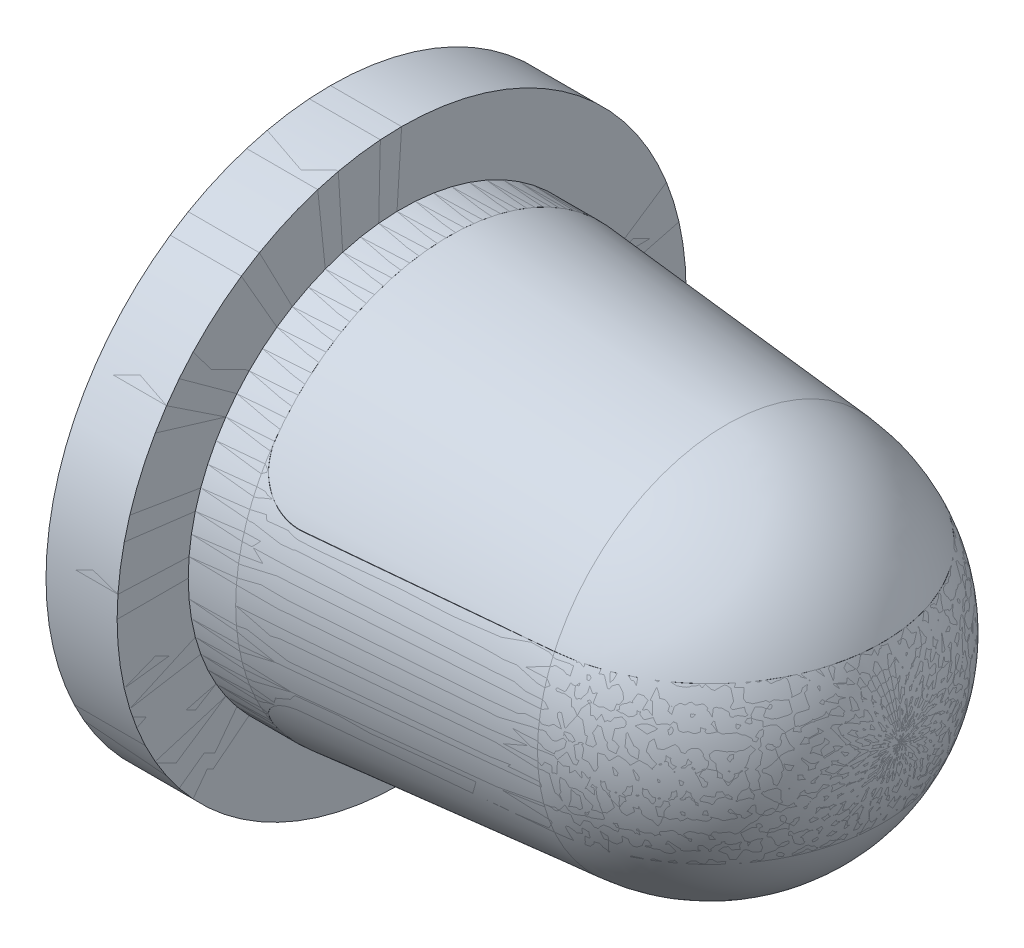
ISO-10303-21;
HEADER;
FILE_DESCRIPTION(('STEP AP214'),'2;1');
FILE_NAME('part.step','',(''),(''),'','','');
FILE_SCHEMA(('AUTOMOTIVE_DESIGN { 1 0 10303 214 1 1 1 1 }'));
ENDSEC;
DATA;
#1=APPLICATION_CONTEXT('core data for automotive mechanical design processes');
#2=APPLICATION_PROTOCOL_DEFINITION('international standard','automotive_design',2000,#1);
#3=PRODUCT_CONTEXT('',#1,'mechanical');
#4=PRODUCT('Part','Part','',(#3));
#5=PRODUCT_RELATED_PRODUCT_CATEGORY('part','',(#4));
#6=PRODUCT_DEFINITION_FORMATION('','',#4);
#7=PRODUCT_DEFINITION_CONTEXT('part definition',#1,'design');
#8=PRODUCT_DEFINITION('design','',#6,#7);
#9=PRODUCT_DEFINITION_SHAPE('','',#8);
#10=(LENGTH_UNIT() NAMED_UNIT(*) SI_UNIT(.MILLI.,.METRE.));
#11=(NAMED_UNIT(*) PLANE_ANGLE_UNIT() SI_UNIT($,.RADIAN.));
#12=(NAMED_UNIT(*) SI_UNIT($,.STERADIAN.) SOLID_ANGLE_UNIT());
#13=UNCERTAINTY_MEASURE_WITH_UNIT(LENGTH_MEASURE(1.E-05),#10,'distance_accuracy_value','');
#14=(GEOMETRIC_REPRESENTATION_CONTEXT(3) GLOBAL_UNCERTAINTY_ASSIGNED_CONTEXT((#13)) GLOBAL_UNIT_ASSIGNED_CONTEXT((#10,
#11,#12)) REPRESENTATION_CONTEXT('',''));
#15=CARTESIAN_POINT('',(0.,0.,0.));
#16=DIRECTION('',(0.,0.,1.));
#17=DIRECTION('',(1.,0.,0.));
#18=AXIS2_PLACEMENT_3D('',#15,#16,#17);
#19=CARTESIAN_POINT('',(0.35101111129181,0.,0.));
#20=DIRECTION('',(-1.,0.,0.));
#21=DIRECTION('',(0.,0.,1.));
#22=AXIS2_PLACEMENT_3D('',#19,#20,#21);
#23=CONICAL_SURFACE('',#22,3.98456913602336,0.0878657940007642);
#24=CARTESIAN_POINT('',(0.351011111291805,0.,0.));
#25=DIRECTION('',(-1.,0.,0.));
#26=DIRECTION('',(0.,0.809016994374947,0.587785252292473));
#27=AXIS2_PLACEMENT_3D('',#24,#25,#26);
#28=CIRCLE('',#27,3.98456913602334);
#29=CARTESIAN_POINT('',(0.351011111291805,-1.65,-3.62688450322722));
#30=VERTEX_POINT('',#29);
#31=CARTESIAN_POINT('',(0.351011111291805,1.65,-3.62688450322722));
#32=VERTEX_POINT('',#31);
#33=EDGE_CURVE('P0_E429',#30,#32,#28,.F.);
#34=ORIENTED_EDGE('',*,*,#33,.F.);
#35=CARTESIAN_POINT('',(4.01721205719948,-1.65,-3.26876784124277));
#36=CARTESIAN_POINT('',(2.9005598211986,-1.65,-3.37892652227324));
#37=CARTESIAN_POINT('',(1.7838041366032,-1.65,-3.48802983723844));
#38=CARTESIAN_POINT('',(-0.449871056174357,-1.65,-3.70453803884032));
#39=CARTESIAN_POINT('',(-1.56679056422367,-1.65,-3.81194292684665));
#40=CARTESIAN_POINT('',(-3.11315445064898,-1.65,-3.95974562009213));
#41=CARTESIAN_POINT('',(-3.54254660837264,-1.65,-4.00069138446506));
#42=CARTESIAN_POINT('',(-5.30367241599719,-1.65,-4.16826823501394));
#43=CARTESIAN_POINT('',(-6.63547736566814,-1.65,-4.29415023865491));
#44=CARTESIAN_POINT('',(-9.29920940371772,-1.65,-4.54461339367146));
#45=CARTESIAN_POINT('',(-10.6311364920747,-1.65,-4.66919454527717));
#46=CARTESIAN_POINT('',(-11.9631063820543,-1.65,-4.7933108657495));
#47=B_SPLINE_CURVE_WITH_KNOTS('',3,(#35,#36,#37,#38,#39,#40,#41,#42,#43,#44,#45,#46),
.UNSPECIFIED.,.F.,.F.,(4,2,2,2,2,4),(0.,3.36621669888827,6.73243068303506,8.02645062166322,
12.0396724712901,16.0528936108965),.UNSPECIFIED.);
#48=CARTESIAN_POINT('',(-4.5,-1.65,-4.09175106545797));
#49=VERTEX_POINT('',#48);
#50=EDGE_CURVE('P0_E412',#30,#49,#47,.T.);
#51=ORIENTED_EDGE('',*,*,#50,.T.);
#52=CARTESIAN_POINT('',(-4.5,-1.65,-4.09175106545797));
#53=CARTESIAN_POINT('',(-4.52576376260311,-1.64999950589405,-4.09419707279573));
#54=CARTESIAN_POINT('',(-4.55155401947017,-1.65099643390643,-4.09624598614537));
#55=CARTESIAN_POINT('',(-4.60303311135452,-1.65498681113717,-4.09952685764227));
#56=CARTESIAN_POINT('',(-4.6287219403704,-1.6579803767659,-4.10075876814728));
#57=CARTESIAN_POINT('',(-4.70532632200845,-1.66994684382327,-4.10319213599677));
#58=CARTESIAN_POINT('',(-4.75585505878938,-1.68190551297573,-4.10313842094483));
#59=CARTESIAN_POINT('',(-4.85436399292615,-1.7134599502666,-4.09946802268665));
#60=CARTESIAN_POINT('',(-4.9023415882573,-1.73306335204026,-4.09584777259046));
#61=CARTESIAN_POINT('',(-4.99434418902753,-1.77921334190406,-4.08485330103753));
#62=CARTESIAN_POINT('',(-5.03837100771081,-1.80575672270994,-4.07748081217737));
#63=CARTESIAN_POINT('',(-5.12105787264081,-1.86460382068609,-4.05892323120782));
#64=CARTESIAN_POINT('',(-5.15974937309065,-1.89687096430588,-4.04776195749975));
#65=CARTESIAN_POINT('',(-5.23122958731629,-1.96605647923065,-4.02162248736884));
#66=CARTESIAN_POINT('',(-5.26401694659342,-2.00297591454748,-4.00664341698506));
#67=CARTESIAN_POINT('',(-5.3241175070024,-2.08136318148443,-3.97248000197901));
#68=CARTESIAN_POINT('',(-5.35122088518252,-2.12293906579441,-3.95317596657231));
#69=CARTESIAN_POINT('',(-5.39842859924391,-2.20818184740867,-3.91097722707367));
#70=CARTESIAN_POINT('',(-5.41852950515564,-2.2518497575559,-3.88808077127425));
#71=CARTESIAN_POINT('',(-5.4535654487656,-2.34438700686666,-3.83668102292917));
#72=CARTESIAN_POINT('',(-5.46778533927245,-2.39334074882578,-3.80784628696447));
#73=CARTESIAN_POINT('',(-5.4885076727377,-2.49082556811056,-3.74699517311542));
#74=CARTESIAN_POINT('',(-5.49501414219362,-2.53935685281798,-3.71498046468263));
#75=CARTESIAN_POINT('',(-5.49935288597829,-2.60827446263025,-3.66702390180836));
#76=CARTESIAN_POINT('',(-5.5000009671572,-2.62922722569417,-3.65210243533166));
#77=CARTESIAN_POINT('',(-5.5,-2.65,-3.63696301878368));
#78=B_SPLINE_CURVE_WITH_KNOTS('',3,(#52,#53,#54,#55,#56,#57,#58,#59,#60,#61,#62,#63,#64,#65,#66,
#67,#68,#69,#70,#71,#72,#73,#74,#75,#76,#77),.UNSPECIFIED.,.F.,.F.,(4,2,2,2,2,2,2,2,2,2,2,2,4),
(0.,0.0775936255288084,0.155191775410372,0.310164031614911,0.465291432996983,0.620347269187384,
0.774445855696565,0.928579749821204,1.08766780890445,1.24683368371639,1.42187369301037,
1.596822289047,1.67396463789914),.UNSPECIFIED.);
#79=CARTESIAN_POINT('',(-5.5,-2.65,-3.63696301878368));
#80=VERTEX_POINT('',#79);
#81=EDGE_CURVE('P0_E509',#49,#80,#78,.T.);
#82=ORIENTED_EDGE('',*,*,#81,.T.);
#83=CARTESIAN_POINT('',(-5.5,0.,0.));
#84=DIRECTION('',(-1.,0.,0.));
#85=DIRECTION('',(0.,0.809016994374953,0.587785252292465));
#86=AXIS2_PLACEMENT_3D('',#83,#84,#85);
#87=CIRCLE('',#86,4.50000000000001);
#88=CARTESIAN_POINT('',(-5.5,2.65,-3.63696301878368));
#89=VERTEX_POINT('',#88);
#90=EDGE_CURVE('P0_E432',#89,#80,#87,.T.);
#91=ORIENTED_EDGE('',*,*,#90,.F.);
#92=CARTESIAN_POINT('',(-5.5,2.65,-3.63696301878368));
#93=CARTESIAN_POINT('',(-5.49999616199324,2.6223082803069,-3.65714081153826));
#94=CARTESIAN_POINT('',(-5.4988483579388,2.59433281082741,-3.67691317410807));
#95=CARTESIAN_POINT('',(-5.49410513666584,2.53792817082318,-3.71556436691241));
#96=CARTESIAN_POINT('',(-5.49050679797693,2.50949849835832,-3.73444210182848));
#97=CARTESIAN_POINT('',(-5.47576366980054,2.4235898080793,-3.78967301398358));
#98=CARTESIAN_POINT('',(-5.46066839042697,2.36569718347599,-3.82447372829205));
#99=CARTESIAN_POINT('',(-5.42230681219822,2.26014010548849,-3.88372154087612));
#100=CARTESIAN_POINT('',(-5.4007008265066,2.21230014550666,-3.90893610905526));
#101=CARTESIAN_POINT('',(-5.34915311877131,2.11919006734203,-3.95503424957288));
#102=CARTESIAN_POINT('',(-5.31923052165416,2.07391433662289,-3.97592756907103));
#103=CARTESIAN_POINT('',(-5.25107038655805,1.98747549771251,-4.01313908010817));
#104=CARTESIAN_POINT('',(-5.21278731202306,1.94633678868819,-4.02943104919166));
#105=CARTESIAN_POINT('',(-5.12881734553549,1.87039083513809,-4.0570983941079));
#106=CARTESIAN_POINT('',(-5.08312902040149,1.83558481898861,-4.06847281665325));
#107=CARTESIAN_POINT('',(-4.99015582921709,1.77678799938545,-4.08554292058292));
#108=CARTESIAN_POINT('',(-4.94338171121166,1.75210715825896,-4.09165643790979));
#109=CARTESIAN_POINT('',(-4.84623016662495,1.71036377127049,-4.10000954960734));
#110=CARTESIAN_POINT('',(-4.79585416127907,1.69329823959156,-4.10225066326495));
#111=CARTESIAN_POINT('',(-4.70446031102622,1.67025580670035,-4.10298915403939));
#112=CARTESIAN_POINT('',(-4.66384552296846,1.66265887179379,-4.10220673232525));
#113=CARTESIAN_POINT('',(-4.58212491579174,1.65252412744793,-4.09853289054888));
#114=CARTESIAN_POINT('',(-4.54101963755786,1.64998118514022,-4.09564361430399));
#115=CARTESIAN_POINT('',(-4.5,1.65,-4.09175106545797));
#116=B_SPLINE_CURVE_WITH_KNOTS('',3,(#92,#93,#94,#95,#96,#97,#98,#99,#100,#101,#102,#103,#104,
#105,#106,#107,#108,#109,#110,#111,#112,#113,#114,#115),.UNSPECIFIED.,.F.,.F.,(4,2,2,2,2,2,2,2,
2,2,2,4),(0.,0.102742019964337,0.205606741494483,0.412092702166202,0.586074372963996,
0.759659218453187,0.934214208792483,1.10880302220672,1.26773253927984,1.42659968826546,
1.5502247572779,1.67372420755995),.UNSPECIFIED.);
#117=CARTESIAN_POINT('',(-4.5,1.65,-4.09175106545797));
#118=VERTEX_POINT('',#117);
#119=EDGE_CURVE('P0_E11',#89,#118,#116,.T.);
#120=ORIENTED_EDGE('',*,*,#119,.T.);
#121=CARTESIAN_POINT('',(-11.9631063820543,1.65,-4.7933108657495));
#122=CARTESIAN_POINT('',(-10.6311348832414,1.65,-4.6691965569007));
#123=CARTESIAN_POINT('',(-9.29920667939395,1.65,-4.544614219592));
#124=CARTESIAN_POINT('',(-6.63547497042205,1.65,-4.29414893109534));
#125=CARTESIAN_POINT('',(-5.303671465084,1.65,-4.16826598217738));
#126=CARTESIAN_POINT('',(-2.64022142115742,1.65,-3.91483436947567));
#127=CARTESIAN_POINT('',(-1.30857488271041,1.65,-3.78728570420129));
#128=CARTESIAN_POINT('',(0.688732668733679,1.65,-3.59427131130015));
#129=CARTESIAN_POINT('',(1.35447539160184,1.65,-3.52965122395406));
#130=CARTESIAN_POINT('',(2.68589552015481,1.65,-3.39973981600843));
#131=CARTESIAN_POINT('',(3.35157292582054,1.65,-3.33444849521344));
#132=CARTESIAN_POINT('',(4.01721205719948,1.65,-3.26876784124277));
#133=B_SPLINE_CURVE_WITH_KNOTS('',3,(#121,#122,#123,#124,#125,#126,#127,#128,#129,#130,#131,
#132),.UNSPECIFIED.,.F.,.F.,(4,2,2,2,2,4),(0.,4.01322499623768,8.02644298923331,
12.0396645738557,14.0462788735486,16.0528937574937),.UNSPECIFIED.);
#134=EDGE_CURVE('P0_E495',#118,#32,#133,.T.);
#135=ORIENTED_EDGE('',*,*,#134,.T.);
#136=EDGE_LOOP('',(#34,#51,#82,#91,#120,#135));
#137=FACE_BOUND('',#136,.T.);
#138=ADVANCED_FACE('P0_F350',(#137),#23,.T.);
#139=CARTESIAN_POINT('',(-7.,-4.1904067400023,0.66369522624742));
#140=DIRECTION('',(-1.,0.,0.));
#141=DIRECTION('',(0.,0.809016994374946,0.587785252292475));
#142=AXIS2_PLACEMENT_3D('',#139,#140,#141);
#143=PLANE('',#142);
#144=CARTESIAN_POINT('',(-7.,0.,0.));
#145=DIRECTION('',(-1.,0.,0.));
#146=DIRECTION('',(0.,0.,1.));
#147=AXIS2_PLACEMENT_3D('',#144,#145,#146);
#148=CIRCLE('',#147,2.99999999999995);
#149=CARTESIAN_POINT('',(-7.,0.,2.99999999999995));
#150=VERTEX_POINT('',#149);
#151=EDGE_CURVE('P0_E615',#150,#150,#148,.F.);
#152=ORIENTED_EDGE('',*,*,#151,.F.);
#153=EDGE_LOOP('',(#152));
#154=FACE_BOUND('',#153,.T.);
#155=ADVANCED_FACE('P0_F537',(#154),#143,.T.);
#156=CARTESIAN_POINT('',(-7.,0.,0.));
#157=DIRECTION('',(-1.,0.,0.));
#158=DIRECTION('',(0.,0.,1.));
#159=AXIS2_PLACEMENT_3D('',#156,#157,#158);
#160=CYLINDRICAL_SURFACE('',#159,2.99999999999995);
#161=CARTESIAN_POINT('',(-9.,0.,0.));
#162=DIRECTION('',(-1.,0.,0.));
#163=DIRECTION('',(0.,0.,1.));
#164=AXIS2_PLACEMENT_3D('',#161,#162,#163);
#165=CIRCLE('',#164,2.99999999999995);
#166=CARTESIAN_POINT('',(-9.,0.,2.99999999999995));
#167=VERTEX_POINT('',#166);
#168=EDGE_CURVE('P0_E610',#167,#167,#165,.F.);
#169=ORIENTED_EDGE('',*,*,#168,.F.);
#170=EDGE_LOOP('',(#169));
#171=FACE_BOUND('',#170,.T.);
#172=ORIENTED_EDGE('',*,*,#151,.T.);
#173=EDGE_LOOP('',(#172));
#174=FACE_BOUND('',#173,.T.);
#175=ADVANCED_FACE('P0_F542',(#171,#174),#160,.F.);
#176=CARTESIAN_POINT('',(-9.,-4.888807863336,0.77431109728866));
#177=DIRECTION('',(-1.,0.,0.));
#178=DIRECTION('',(0.,0.809016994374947,0.587785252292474));
#179=AXIS2_PLACEMENT_3D('',#176,#177,#178);
#180=PLANE('',#179);
#181=ORIENTED_EDGE('',*,*,#168,.T.);
#182=EDGE_LOOP('',(#181));
#183=FACE_BOUND('',#182,.T.);
#184=CARTESIAN_POINT('',(-9.,0.,0.));
#185=DIRECTION('',(-1.,0.,0.));
#186=DIRECTION('',(0.,0.,1.));
#187=AXIS2_PLACEMENT_3D('',#184,#185,#186);
#188=CIRCLE('',#187,3.50000000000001);
#189=CARTESIAN_POINT('',(-9.,0.,3.50000000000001));
#190=VERTEX_POINT('',#189);
#191=EDGE_CURVE('P0_E605',#190,#190,#188,.T.);
#192=ORIENTED_EDGE('',*,*,#191,.T.);
#193=EDGE_LOOP('',(#192));
#194=FACE_BOUND('',#193,.T.);
#195=ADVANCED_FACE('P0_F557',(#183,#194),#180,.T.);
#196=CARTESIAN_POINT('',(-8.5,0.,0.));
#197=DIRECTION('',(-1.,0.,0.));
#198=DIRECTION('',(0.,0.,1.));
#199=AXIS2_PLACEMENT_3D('',#196,#197,#198);
#200=CYLINDRICAL_SURFACE('',#199,3.50000000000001);
#201=CARTESIAN_POINT('',(-8.5,0.,0.));
#202=DIRECTION('',(-1.,0.,0.));
#203=DIRECTION('',(0.,0.,1.));
#204=AXIS2_PLACEMENT_3D('',#201,#202,#203);
#205=CIRCLE('',#204,3.50000000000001);
#206=CARTESIAN_POINT('',(-8.5,0.,3.50000000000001));
#207=VERTEX_POINT('',#206);
#208=EDGE_CURVE('P0_E600',#207,#207,#205,.F.);
#209=ORIENTED_EDGE('',*,*,#208,.F.);
#210=EDGE_LOOP('',(#209));
#211=FACE_BOUND('',#210,.T.);
#212=ORIENTED_EDGE('',*,*,#191,.F.);
#213=EDGE_LOOP('',(#212));
#214=FACE_BOUND('',#213,.T.);
#215=ADVANCED_FACE('P0_F559',(#211,#214),#200,.T.);
#216=CARTESIAN_POINT('',(-8.5,-5.5872089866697,0.8849269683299));
#217=DIRECTION('',(-1.,0.,0.));
#218=DIRECTION('',(0.,0.809016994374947,0.587785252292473));
#219=AXIS2_PLACEMENT_3D('',#216,#217,#218);
#220=PLANE('',#219);
#221=ORIENTED_EDGE('',*,*,#208,.T.);
#222=EDGE_LOOP('',(#221));
#223=FACE_BOUND('',#222,.T.);
#224=CARTESIAN_POINT('',(-8.5,0.,0.));
#225=DIRECTION('',(-1.,0.,0.));
#226=DIRECTION('',(0.,0.,1.));
#227=AXIS2_PLACEMENT_3D('',#224,#225,#226);
#228=CIRCLE('',#227,4.00000000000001);
#229=CARTESIAN_POINT('',(-8.5,0.,4.00000000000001));
#230=VERTEX_POINT('',#229);
#231=EDGE_CURVE('P0_E589',#230,#230,#228,.T.);
#232=ORIENTED_EDGE('',*,*,#231,.T.);
#233=EDGE_LOOP('',(#232));
#234=FACE_BOUND('',#233,.T.);
#235=ADVANCED_FACE('P0_F562',(#223,#234),#220,.T.);
#236=CARTESIAN_POINT('',(-8.,0.,0.));
#237=DIRECTION('',(-1.,0.,0.));
#238=DIRECTION('',(0.,0.,1.));
#239=AXIS2_PLACEMENT_3D('',#236,#237,#238);
#240=CYLINDRICAL_SURFACE('',#239,4.00000000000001);
#241=CARTESIAN_POINT('',(-8.,0.,0.));
#242=DIRECTION('',(-1.,0.,0.));
#243=DIRECTION('',(0.,0.,1.));
#244=AXIS2_PLACEMENT_3D('',#241,#242,#243);
#245=CIRCLE('',#244,4.00000000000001);
#246=CARTESIAN_POINT('',(-8.,0.,4.00000000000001));
#247=VERTEX_POINT('',#246);
#248=EDGE_CURVE('P0_E585',#247,#247,#245,.F.);
#249=ORIENTED_EDGE('',*,*,#248,.F.);
#250=EDGE_LOOP('',(#249));
#251=FACE_BOUND('',#250,.T.);
#252=ORIENTED_EDGE('',*,*,#231,.F.);
#253=EDGE_LOOP('',(#252));
#254=FACE_BOUND('',#253,.T.);
#255=ADVANCED_FACE('P0_F564',(#251,#254),#240,.T.);
#256=CARTESIAN_POINT('',(-8.,-8.3808134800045,1.3273904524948));
#257=DIRECTION('',(-1.,0.,0.));
#258=DIRECTION('',(0.,0.809016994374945,0.587785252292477));
#259=AXIS2_PLACEMENT_3D('',#256,#257,#258);
#260=PLANE('',#259);
#261=ORIENTED_EDGE('',*,*,#248,.T.);
#262=EDGE_LOOP('',(#261));
#263=FACE_BOUND('',#262,.T.);
#264=CARTESIAN_POINT('',(-8.,0.,0.));
#265=DIRECTION('',(-1.,0.,0.));
#266=DIRECTION('',(0.,0.,1.));
#267=AXIS2_PLACEMENT_3D('',#264,#265,#266);
#268=CIRCLE('',#267,5.99999999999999);
#269=CARTESIAN_POINT('',(-8.,0.,5.99999999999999));
#270=VERTEX_POINT('',#269);
#271=EDGE_CURVE('P0_E583',#270,#270,#268,.T.);
#272=ORIENTED_EDGE('',*,*,#271,.T.);
#273=EDGE_LOOP('',(#272));
#274=FACE_BOUND('',#273,.T.);
#275=ADVANCED_FACE('P0_F566',(#263,#274),#260,.T.);
#276=CARTESIAN_POINT('',(-6.5,0.,0.));
#277=DIRECTION('',(-1.,0.,0.));
#278=DIRECTION('',(0.,0.,1.));
#279=AXIS2_PLACEMENT_3D('',#276,#277,#278);
#280=CYLINDRICAL_SURFACE('',#279,5.99999999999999);
#281=CARTESIAN_POINT('',(-6.5,0.,0.));
#282=DIRECTION('',(-1.,0.,0.));
#283=DIRECTION('',(0.,0.,1.));
#284=AXIS2_PLACEMENT_3D('',#281,#282,#283);
#285=CIRCLE('',#284,5.99999999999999);
#286=CARTESIAN_POINT('',(-6.5,0.,5.99999999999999));
#287=VERTEX_POINT('',#286);
#288=EDGE_CURVE('P0_E580',#287,#287,#285,.F.);
#289=ORIENTED_EDGE('',*,*,#288,.F.);
#290=EDGE_LOOP('',(#289));
#291=FACE_BOUND('',#290,.T.);
#292=ORIENTED_EDGE('',*,*,#271,.F.);
#293=EDGE_LOOP('',(#292));
#294=FACE_BOUND('',#293,.T.);
#295=ADVANCED_FACE('P0_F568',(#291,#294),#280,.T.);
#296=CARTESIAN_POINT('',(-6.5,-1.3273904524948,-8.3808134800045));
#297=DIRECTION('',(1.,0.,0.));
#298=DIRECTION('',(0.,0.809016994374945,0.587785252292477));
#299=AXIS2_PLACEMENT_3D('',#296,#297,#298);
#300=PLANE('',#299);
#301=CARTESIAN_POINT('',(-6.5,0.,0.));
#302=DIRECTION('',(-1.,0.,0.));
#303=DIRECTION('',(0.,0.,1.));
#304=AXIS2_PLACEMENT_3D('',#301,#302,#303);
#305=CIRCLE('',#304,4.50000000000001);
#306=CARTESIAN_POINT('',(-6.5,0.,4.50000000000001));
#307=VERTEX_POINT('',#306);
#308=EDGE_CURVE('P0_E442',#307,#307,#305,.T.);
#309=ORIENTED_EDGE('',*,*,#308,.T.);
#310=EDGE_LOOP('',(#309));
#311=FACE_BOUND('',#310,.T.);
#312=ORIENTED_EDGE('',*,*,#288,.T.);
#313=EDGE_LOOP('',(#312));
#314=FACE_BOUND('',#313,.T.);
#315=ADVANCED_FACE('P0_F352',(#311,#314),#300,.T.);
#316=CARTESIAN_POINT('',(-5.5,0.,0.));
#317=DIRECTION('',(-1.,0.,0.));
#318=DIRECTION('',(0.,0.,1.));
#319=AXIS2_PLACEMENT_3D('',#316,#317,#318);
#320=CYLINDRICAL_SURFACE('',#319,4.50000000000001);
#321=ORIENTED_EDGE('',*,*,#90,.T.);
#322=CARTESIAN_POINT('',(-5.5,-2.65,3.63696301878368));
#323=VERTEX_POINT('',#322);
#324=EDGE_CURVE('P0_E641',#80,#323,#87,.T.);
#325=ORIENTED_EDGE('',*,*,#324,.T.);
#326=CARTESIAN_POINT('',(-5.5,2.65,3.63696301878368));
#327=VERTEX_POINT('',#326);
#328=EDGE_CURVE('P0_E367',#323,#327,#87,.T.);
#329=ORIENTED_EDGE('',*,*,#328,.T.);
#330=EDGE_CURVE('P0_E635',#327,#89,#87,.T.);
#331=ORIENTED_EDGE('',*,*,#330,.T.);
#332=EDGE_LOOP('',(#321,#325,#329,#331));
#333=FACE_BOUND('',#332,.T.);
#334=ORIENTED_EDGE('',*,*,#308,.F.);
#335=EDGE_LOOP('',(#334));
#336=FACE_BOUND('',#335,.T.);
#337=ADVANCED_FACE('P0_F484',(#333,#336),#320,.T.);
#338=ORIENTED_EDGE('',*,*,#328,.F.);
#339=CARTESIAN_POINT('',(-5.5,-2.65,3.63696301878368));
#340=CARTESIAN_POINT('',(-5.49999616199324,-2.6223082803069,3.65714081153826));
#341=CARTESIAN_POINT('',(-5.4988483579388,-2.59433281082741,3.67691317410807));
#342=CARTESIAN_POINT('',(-5.49410513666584,-2.53792817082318,3.71556436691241));
#343=CARTESIAN_POINT('',(-5.49050679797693,-2.50949849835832,3.73444210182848));
#344=CARTESIAN_POINT('',(-5.47576366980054,-2.4235898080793,3.78967301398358));
#345=CARTESIAN_POINT('',(-5.46066839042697,-2.36569718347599,3.82447372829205));
#346=CARTESIAN_POINT('',(-5.42230681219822,-2.26014010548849,3.88372154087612));
#347=CARTESIAN_POINT('',(-5.4007008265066,-2.21230014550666,3.90893610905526));
#348=CARTESIAN_POINT('',(-5.34915311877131,-2.11919006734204,3.95503424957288));
#349=CARTESIAN_POINT('',(-5.31923052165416,-2.07391433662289,3.97592756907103));
#350=CARTESIAN_POINT('',(-5.25107038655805,-1.98747549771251,4.01313908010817));
#351=CARTESIAN_POINT('',(-5.21278731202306,-1.94633678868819,4.02943104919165));
#352=CARTESIAN_POINT('',(-5.12881734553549,-1.87039083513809,4.0570983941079));
#353=CARTESIAN_POINT('',(-5.08312902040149,-1.83558481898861,4.06847281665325));
#354=CARTESIAN_POINT('',(-4.99015582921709,-1.77678799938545,4.08554292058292));
#355=CARTESIAN_POINT('',(-4.94338171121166,-1.75210715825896,4.09165643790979));
#356=CARTESIAN_POINT('',(-4.84623016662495,-1.71036377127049,4.10000954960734));
#357=CARTESIAN_POINT('',(-4.79585416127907,-1.69329823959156,4.10225066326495));
#358=CARTESIAN_POINT('',(-4.70446031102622,-1.67025580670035,4.10298915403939));
#359=CARTESIAN_POINT('',(-4.66384552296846,-1.66265887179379,4.10220673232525));
#360=CARTESIAN_POINT('',(-4.58212491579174,-1.65252412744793,4.09853289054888));
#361=CARTESIAN_POINT('',(-4.54101963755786,-1.64998118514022,4.09564361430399));
#362=CARTESIAN_POINT('',(-4.5,-1.65,4.09175106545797));
#363=B_SPLINE_CURVE_WITH_KNOTS('',3,(#339,#340,#341,#342,#343,#344,#345,#346,#347,#348,#349,
#350,#351,#352,#353,#354,#355,#356,#357,#358,#359,#360,#361,#362),.UNSPECIFIED.,.F.,.F.,(4,2,2,
2,2,2,2,2,2,2,2,4),(0.,0.102742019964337,0.205606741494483,0.412092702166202,0.586074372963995,
0.759659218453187,0.934214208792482,1.10880302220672,1.26773253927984,1.42659968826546,
1.5502247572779,1.67372420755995),.UNSPECIFIED.);
#364=CARTESIAN_POINT('',(-4.5,-1.65,4.09175106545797));
#365=VERTEX_POINT('',#364);
#366=EDGE_CURVE('P0_E409',#323,#365,#363,.T.);
#367=ORIENTED_EDGE('',*,*,#366,.T.);
#368=CARTESIAN_POINT('',(-11.9631063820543,-1.65,4.7933108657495));
#369=CARTESIAN_POINT('',(-10.6311348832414,-1.65,4.6691965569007));
#370=CARTESIAN_POINT('',(-9.29920667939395,-1.65,4.544614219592));
#371=CARTESIAN_POINT('',(-6.63547497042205,-1.65,4.29414893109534));
#372=CARTESIAN_POINT('',(-5.303671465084,-1.65,4.16826598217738));
#373=CARTESIAN_POINT('',(-2.64022142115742,-1.65,3.91483436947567));
#374=CARTESIAN_POINT('',(-1.30857488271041,-1.65,3.78728570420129));
#375=CARTESIAN_POINT('',(0.688732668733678,-1.65,3.59427131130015));
#376=CARTESIAN_POINT('',(1.35447539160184,-1.65,3.52965122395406));
#377=CARTESIAN_POINT('',(2.68589552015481,-1.65,3.39973981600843));
#378=CARTESIAN_POINT('',(3.35157292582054,-1.65,3.33444849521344));
#379=CARTESIAN_POINT('',(4.01721205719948,-1.65,3.26876784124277));
#380=B_SPLINE_CURVE_WITH_KNOTS('',3,(#368,#369,#370,#371,#372,#373,#374,#375,#376,#377,#378,
#379),.UNSPECIFIED.,.F.,.F.,(4,2,2,2,2,4),(0.,4.01322499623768,8.02644298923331,
12.0396645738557,14.0462788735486,16.0528937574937),.UNSPECIFIED.);
#381=CARTESIAN_POINT('',(0.351011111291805,-1.65,3.62688450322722));
#382=VERTEX_POINT('',#381);
#383=EDGE_CURVE('P0_E402',#365,#382,#380,.T.);
#384=ORIENTED_EDGE('',*,*,#383,.T.);
#385=CARTESIAN_POINT('',(0.351011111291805,1.65,3.62688450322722));
#386=VERTEX_POINT('',#385);
#387=EDGE_CURVE('P0_E407',#386,#382,#28,.F.);
#388=ORIENTED_EDGE('',*,*,#387,.F.);
#389=CARTESIAN_POINT('',(4.01721205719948,1.65,3.26876784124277));
#390=CARTESIAN_POINT('',(2.9005598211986,1.65,3.37892652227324));
#391=CARTESIAN_POINT('',(1.7838041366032,1.65,3.48802983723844));
#392=CARTESIAN_POINT('',(-0.449871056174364,1.65,3.70453803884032));
#393=CARTESIAN_POINT('',(-1.56679056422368,1.65,3.81194292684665));
#394=CARTESIAN_POINT('',(-3.11315445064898,1.65,3.95974562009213));
#395=CARTESIAN_POINT('',(-3.54254660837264,1.65,4.00069138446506));
#396=CARTESIAN_POINT('',(-5.30367241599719,1.65,4.16826823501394));
#397=CARTESIAN_POINT('',(-6.63547736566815,1.65,4.29415023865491));
#398=CARTESIAN_POINT('',(-9.29920940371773,1.65,4.54461339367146));
#399=CARTESIAN_POINT('',(-10.6311364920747,1.65,4.66919454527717));
#400=CARTESIAN_POINT('',(-11.9631063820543,1.65,4.7933108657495));
#401=B_SPLINE_CURVE_WITH_KNOTS('',3,(#389,#390,#391,#392,#393,#394,#395,#396,#397,#398,#399,
#400),.UNSPECIFIED.,.F.,.F.,(4,2,2,2,2,4),(0.,3.36621669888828,6.73243068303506,
8.02645062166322,12.0396724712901,16.0528936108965),.UNSPECIFIED.);
#402=CARTESIAN_POINT('',(-4.50000000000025,1.65,4.09175106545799));
#403=VERTEX_POINT('',#402);
#404=EDGE_CURVE('P0_E488',#386,#403,#401,.T.);
#405=ORIENTED_EDGE('',*,*,#404,.T.);
#406=CARTESIAN_POINT('',(-4.5,1.65,4.09175106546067));
#407=CARTESIAN_POINT('',(-4.52576376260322,1.64999950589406,4.09419707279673));
#408=CARTESIAN_POINT('',(-4.55155401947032,1.65099643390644,4.09624598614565));
#409=CARTESIAN_POINT('',(-4.60303311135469,1.65498681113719,4.099526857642));
#410=CARTESIAN_POINT('',(-4.62872194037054,1.65798037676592,4.10075876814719));
#411=CARTESIAN_POINT('',(-4.70532632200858,1.6699468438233,4.10319213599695));
#412=CARTESIAN_POINT('',(-4.75585505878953,1.68190551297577,4.10313842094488));
#413=CARTESIAN_POINT('',(-4.85436399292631,1.71345995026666,4.09946802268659));
#414=CARTESIAN_POINT('',(-4.90234158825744,1.73306335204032,4.09584777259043));
#415=CARTESIAN_POINT('',(-4.99434418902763,1.77921334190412,4.08485330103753));
#416=CARTESIAN_POINT('',(-5.03837100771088,1.80575672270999,4.07748081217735));
#417=CARTESIAN_POINT('',(-5.12105787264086,1.86460382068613,4.0589232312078));
#418=CARTESIAN_POINT('',(-5.1597493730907,1.89687096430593,4.04776195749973));
#419=CARTESIAN_POINT('',(-5.23122958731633,1.9660564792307,4.02162248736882));
#420=CARTESIAN_POINT('',(-5.26401694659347,2.00297591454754,4.00664341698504));
#421=CARTESIAN_POINT('',(-5.32411750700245,2.08136318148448,3.97248000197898));
#422=CARTESIAN_POINT('',(-5.35122088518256,2.12293906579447,3.95317596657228));
#423=CARTESIAN_POINT('',(-5.39842859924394,2.20818184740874,3.91097722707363));
#424=CARTESIAN_POINT('',(-5.41852950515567,2.25184975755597,3.88808077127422));
#425=CARTESIAN_POINT('',(-5.45356544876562,2.34438700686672,3.83668102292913));
#426=CARTESIAN_POINT('',(-5.46778533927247,2.39334074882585,3.80784628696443));
#427=CARTESIAN_POINT('',(-5.48850767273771,2.49082556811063,3.74699517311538));
#428=CARTESIAN_POINT('',(-5.49501414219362,2.53935685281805,3.71498046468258));
#429=CARTESIAN_POINT('',(-5.49935288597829,2.6082744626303,3.66702390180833));
#430=CARTESIAN_POINT('',(-5.5000009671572,2.62922722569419,3.65210243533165));
#431=CARTESIAN_POINT('',(-5.5,2.65,3.63696301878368));
#432=B_SPLINE_CURVE_WITH_KNOTS('',3,(#406,#407,#408,#409,#410,#411,#412,#413,#414,#415,#416,
#417,#418,#419,#420,#421,#422,#423,#424,#425,#426,#427,#428,#429,#430,#431),.UNSPECIFIED.,.F.,
.F.,(4,2,2,2,2,2,2,2,2,2,2,2,4),(0.,0.0775936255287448,0.155191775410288,0.310164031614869,
0.465291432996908,0.620347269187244,0.774445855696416,0.928579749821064,1.08766780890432,
1.24683368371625,1.42187369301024,1.59682228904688,1.67396463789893),.UNSPECIFIED.);
#433=EDGE_CURVE('P0_E360',#403,#327,#432,.T.);
#434=ORIENTED_EDGE('',*,*,#433,.T.);
#435=EDGE_LOOP('',(#338,#367,#384,#388,#405,#434));
#436=FACE_BOUND('',#435,.T.);
#437=ADVANCED_FACE('P0_F404',(#436),#23,.T.);
#438=CARTESIAN_POINT('',(-4.,0.,0.));
#439=CARTESIAN_POINT('',(-4.,3.2360679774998,2.3511410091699));
#440=CARTESIAN_POINT('',(0.,3.2360679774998,2.3511410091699));
#441=CARTESIAN_POINT('',(4.,3.2360679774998,2.3511410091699));
#442=CARTESIAN_POINT('',(4.,0.,0.));
#443=(BOUNDED_CURVE() B_SPLINE_CURVE(2,(#438,#439,#440,#441,#442),.UNSPECIFIED.,.F.,
.F.) B_SPLINE_CURVE_WITH_KNOTS((3,2,3),(0.,0.5,1.),
.UNSPECIFIED.) CURVE() GEOMETRIC_REPRESENTATION_ITEM() RATIONAL_B_SPLINE_CURVE((1.,
0.70710678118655,1.,0.70710678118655,1.)) REPRESENTATION_ITEM(''));
#444=CARTESIAN_POINT('',(0.,0.,0.));
#445=DIRECTION('',(-1.,0.,0.));
#446=AXIS1_PLACEMENT('',#444,#445);
#447=SURFACE_OF_REVOLUTION('',#443,#446);
#448=CARTESIAN_POINT('',(0.351011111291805,-1.65,-3.62688450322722));
#449=CARTESIAN_POINT('',(0.453021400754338,-1.65,-3.61702177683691));
#450=CARTESIAN_POINT('',(0.554608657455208,-1.65,-3.60283633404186));
#451=CARTESIAN_POINT('',(0.756223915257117,-1.65,-3.56596537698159));
#452=CARTESIAN_POINT('',(0.85625199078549,-1.65,-3.54328026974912));
#453=CARTESIAN_POINT('',(1.05397601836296,-1.65,-3.48957327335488));
#454=CARTESIAN_POINT('',(1.15167356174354,-1.65,-3.45855726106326));
#455=CARTESIAN_POINT('',(1.34408597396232,-1.65,-3.38842633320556));
#456=CARTESIAN_POINT('',(1.43880087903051,-1.65,-3.34931151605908));
#457=CARTESIAN_POINT('',(1.71755017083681,-1.65,-3.22015102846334));
#458=CARTESIAN_POINT('',(1.89627285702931,-1.65,-3.11826650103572));
#459=CARTESIAN_POINT('',(2.23394097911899,-1.65,-2.88600977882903));
#460=CARTESIAN_POINT('',(2.39289027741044,-1.65,-2.75564316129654));
#461=CARTESIAN_POINT('',(2.68667893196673,-1.65,-2.4700602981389));
#462=CARTESIAN_POINT('',(2.82151774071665,-1.65,-2.31484348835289));
#463=CARTESIAN_POINT('',(3.0632360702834,-1.65,-1.98395548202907));
#464=CARTESIAN_POINT('',(3.1701113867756,-1.65,-1.80828121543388));
#465=CARTESIAN_POINT('',(3.35284713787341,-1.65,-1.44148986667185));
#466=CARTESIAN_POINT('',(3.4287090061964,-1.65,-1.25037349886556));
#467=CARTESIAN_POINT('',(3.54726537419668,-1.65,-0.858128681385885));
#468=CARTESIAN_POINT('',(3.58996178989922,-1.65,-0.65700081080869));
#469=CARTESIAN_POINT('',(3.64098391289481,-1.65,-0.250426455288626));
#470=CARTESIAN_POINT('',(3.6493087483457,-1.65,-0.0449798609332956));
#471=CARTESIAN_POINT('',(3.63134871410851,-1.65,0.364396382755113));
#472=CARTESIAN_POINT('',(3.60506360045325,-1.65,0.568326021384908));
#473=CARTESIAN_POINT('',(3.5186302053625,-1.65,0.96887486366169));
#474=CARTESIAN_POINT('',(3.4584824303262,-1.65,1.16549417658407));
#475=CARTESIAN_POINT('',(3.30602934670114,-1.65,1.54584874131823));
#476=CARTESIAN_POINT('',(3.21372330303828,-1.65,1.72958369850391));
#477=CARTESIAN_POINT('',(2.99957625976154,-1.65,2.0789473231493));
#478=CARTESIAN_POINT('',(2.87773544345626,-1.65,2.24457610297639));
#479=CARTESIAN_POINT('',(2.60797395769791,-1.65,2.55302666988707));
#480=CARTESIAN_POINT('',(2.46005356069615,-1.65,2.69584869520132));
#481=CARTESIAN_POINT('',(2.14232266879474,-1.65,2.9546497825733));
#482=CARTESIAN_POINT('',(1.97250858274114,-1.65,3.07062443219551));
#483=CARTESIAN_POINT('',(1.61582133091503,-1.65,3.2723944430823));
#484=CARTESIAN_POINT('',(1.42895360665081,-1.64999999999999,3.35819938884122));
#485=CARTESIAN_POINT('',(1.09355766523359,-1.64999999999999,3.47917840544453));
#486=CARTESIAN_POINT('',(0.94763380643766,-1.65,3.52170988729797));
#487=CARTESIAN_POINT('',(0.651800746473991,-1.65,3.58826964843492));
#488=CARTESIAN_POINT('',(0.501896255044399,-1.65000000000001,3.61231886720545));
#489=CARTESIAN_POINT('',(0.351011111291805,-1.65,3.62688450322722));
#490=B_SPLINE_CURVE_WITH_KNOTS('',3,(#448,#449,#450,#451,#452,#453,#454,#455,#456,#457,#458,
#459,#460,#461,#462,#463,#464,#465,#466,#467,#468,#469,#470,#471,#472,#473,#474,#475,#476,#477,
#478,#479,#480,#481,#482,#483,#484,#485,#486,#487,#488,#489),.UNSPECIFIED.,.F.,.F.,(4,2,2,2,2,2,
2,2,2,2,2,2,2,2,2,2,2,2,2,2,4),(0.,0.307357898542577,0.614701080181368,0.921828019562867,
1.22895122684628,1.84294058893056,2.45680982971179,3.07069300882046,3.68466843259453,
4.29861546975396,4.91252703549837,5.52645417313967,6.14038563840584,6.75430792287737,
7.36824424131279,7.98217674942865,8.59610284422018,9.21012976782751,9.82396144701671,
10.2788210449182,10.7331645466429),.UNSPECIFIED.);
#491=EDGE_CURVE('P0_E416',#30,#382,#490,.T.);
#492=ORIENTED_EDGE('',*,*,#491,.F.);
#493=ORIENTED_EDGE('',*,*,#33,.T.);
#494=CARTESIAN_POINT('',(0.351011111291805,1.65,3.62688450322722));
#495=CARTESIAN_POINT('',(0.453021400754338,1.65,3.61702177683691));
#496=CARTESIAN_POINT('',(0.554608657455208,1.65,3.60283633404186));
#497=CARTESIAN_POINT('',(0.756223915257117,1.65,3.56596537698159));
#498=CARTESIAN_POINT('',(0.85625199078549,1.65,3.54328026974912));
#499=CARTESIAN_POINT('',(1.05397601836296,1.65,3.48957327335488));
#500=CARTESIAN_POINT('',(1.15167356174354,1.65,3.45855726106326));
#501=CARTESIAN_POINT('',(1.34408597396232,1.65,3.38842633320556));
#502=CARTESIAN_POINT('',(1.43880087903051,1.65,3.34931151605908));
#503=CARTESIAN_POINT('',(1.71755017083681,1.65,3.22015102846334));
#504=CARTESIAN_POINT('',(1.89627285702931,1.65,3.11826650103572));
#505=CARTESIAN_POINT('',(2.23394097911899,1.65,2.88600977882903));
#506=CARTESIAN_POINT('',(2.39289027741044,1.65,2.75564316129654));
#507=CARTESIAN_POINT('',(2.68667893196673,1.65,2.4700602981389));
#508=CARTESIAN_POINT('',(2.82151774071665,1.65,2.31484348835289));
#509=CARTESIAN_POINT('',(3.0632360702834,1.65,1.98395548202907));
#510=CARTESIAN_POINT('',(3.17011138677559,1.65,1.80828121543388));
#511=CARTESIAN_POINT('',(3.35284713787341,1.65,1.44148986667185));
#512=CARTESIAN_POINT('',(3.4287090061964,1.65,1.25037349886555));
#513=CARTESIAN_POINT('',(3.54726537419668,1.65,0.858128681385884));
#514=CARTESIAN_POINT('',(3.58996178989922,1.65,0.657000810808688));
#515=CARTESIAN_POINT('',(3.64098391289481,1.65,0.250426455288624));
#516=CARTESIAN_POINT('',(3.6493087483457,1.65,0.0449798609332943));
#517=CARTESIAN_POINT('',(3.63134871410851,1.65,-0.364396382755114));
#518=CARTESIAN_POINT('',(3.60506360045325,1.65,-0.568326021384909));
#519=CARTESIAN_POINT('',(3.5186302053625,1.65,-0.968874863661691));
#520=CARTESIAN_POINT('',(3.4584824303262,1.65,-1.16549417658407));
#521=CARTESIAN_POINT('',(3.30602934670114,1.65,-1.54584874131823));
#522=CARTESIAN_POINT('',(3.21372330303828,1.65,-1.72958369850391));
#523=CARTESIAN_POINT('',(2.99957625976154,1.65,-2.0789473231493));
#524=CARTESIAN_POINT('',(2.87773544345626,1.65,-2.24457610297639));
#525=CARTESIAN_POINT('',(2.60797395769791,1.65,-2.55302666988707));
#526=CARTESIAN_POINT('',(2.46005356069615,1.65,-2.69584869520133));
#527=CARTESIAN_POINT('',(2.14232266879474,1.65,-2.9546497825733));
#528=CARTESIAN_POINT('',(1.97250858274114,1.65,-3.07062443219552));
#529=CARTESIAN_POINT('',(1.61582133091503,1.65,-3.2723944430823));
#530=CARTESIAN_POINT('',(1.4289536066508,1.64999999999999,-3.35819938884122));
#531=CARTESIAN_POINT('',(1.09355766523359,1.64999999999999,-3.47917840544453));
#532=CARTESIAN_POINT('',(0.947633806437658,1.65,-3.52170988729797));
#533=CARTESIAN_POINT('',(0.65180074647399,1.65,-3.58826964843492));
#534=CARTESIAN_POINT('',(0.501896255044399,1.65,-3.61231886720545));
#535=CARTESIAN_POINT('',(0.351011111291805,1.65,-3.62688450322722));
#536=B_SPLINE_CURVE_WITH_KNOTS('',3,(#494,#495,#496,#497,#498,#499,#500,#501,#502,#503,#504,
#505,#506,#507,#508,#509,#510,#511,#512,#513,#514,#515,#516,#517,#518,#519,#520,#521,#522,#523,
#524,#525,#526,#527,#528,#529,#530,#531,#532,#533,#534,#535),.UNSPECIFIED.,.F.,.F.,(4,2,2,2,2,2,
2,2,2,2,2,2,2,2,2,2,2,2,2,2,4),(0.,0.307357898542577,0.614701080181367,0.921828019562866,
1.22895122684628,1.84294058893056,2.45680982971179,3.07069300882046,3.68466843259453,
4.29861546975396,4.91252703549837,5.52645417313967,6.14038563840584,6.75430792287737,
7.36824424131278,7.98217674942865,8.59610284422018,9.21012976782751,9.82396144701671,
10.2788210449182,10.7331645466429),.UNSPECIFIED.);
#537=EDGE_CURVE('P0_E423',#386,#32,#536,.T.);
#538=ORIENTED_EDGE('',*,*,#537,.F.);
#539=ORIENTED_EDGE('',*,*,#387,.T.);
#540=EDGE_LOOP('',(#492,#493,#538,#539));
#541=FACE_BOUND('',#540,.T.);
#542=CARTESIAN_POINT('',(4.00000000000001,0.,0.));
#543=VERTEX_POINT('',#542);
#544=VERTEX_LOOP('',#543);
#545=FACE_BOUND('',#544,.T.);
#546=ADVANCED_FACE('P0_F426',(#541,#545),#447,.F.);
#547=CARTESIAN_POINT('',(-5.5,1.65,-5.99999999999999));
#548=DIRECTION('',(-1.,0.,0.));
#549=DIRECTION('',(0.,0.,1.));
#550=AXIS2_PLACEMENT_3D('',#547,#548,#549);
#551=PLANE('',#550);
#552=ORIENTED_EDGE('',*,*,#330,.F.);
#553=DIRECTION('',(0.,0.,1.));
#554=VECTOR('',#553,1.);
#555=CARTESIAN_POINT('',(-5.5,2.65,-4.18658572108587));
#556=LINE('',#555,#554);
#557=EDGE_CURVE('P0_E628',#327,#89,#556,.F.);
#558=ORIENTED_EDGE('',*,*,#557,.T.);
#559=EDGE_LOOP('',(#552,#558));
#560=FACE_BOUND('',#559,.T.);
#561=ADVANCED_FACE('P0_F544',(#560),#551,.F.);
#562=CARTESIAN_POINT('',(-5.5,1.65,-5.99999999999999));
#563=DIRECTION('',(0.,-1.,0.));
#564=DIRECTION('',(0.,0.,-1.));
#565=AXIS2_PLACEMENT_3D('',#562,#563,#564);
#566=PLANE('',#565);
#567=CARTESIAN_POINT('',(0.,1.65,0.));
#568=DIRECTION('',(0.,-1.,0.));
#569=DIRECTION('',(0.,0.,-1.));
#570=AXIS2_PLACEMENT_3D('',#567,#568,#569);
#571=CIRCLE('',#570,1.13026545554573);
#572=CARTESIAN_POINT('',(0.,1.65,-1.13026545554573));
#573=VERTEX_POINT('',#572);
#574=EDGE_CURVE('P0_E413',#573,#573,#571,.T.);
#575=ORIENTED_EDGE('',*,*,#574,.T.);
#576=EDGE_LOOP('',(#575));
#577=FACE_BOUND('',#576,.T.);
#578=ORIENTED_EDGE('',*,*,#134,.F.);
#579=DIRECTION('',(0.,0.,1.));
#580=VECTOR('',#579,1.);
#581=CARTESIAN_POINT('',(-4.5,1.65,4.18658572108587));
#582=LINE('',#581,#580);
#583=EDGE_CURVE('P0_E630',#118,#403,#582,.T.);
#584=ORIENTED_EDGE('',*,*,#583,.T.);
#585=ORIENTED_EDGE('',*,*,#404,.F.);
#586=ORIENTED_EDGE('',*,*,#537,.T.);
#587=EDGE_LOOP('',(#578,#584,#585,#586));
#588=FACE_BOUND('',#587,.T.);
#589=ADVANCED_FACE('P0_F467',(#577,#588),#566,.F.);
#590=CARTESIAN_POINT('',(-5.5,-1.65,-5.99999999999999));
#591=DIRECTION('',(-1.,0.,0.));
#592=DIRECTION('',(0.,-1.,0.));
#593=AXIS2_PLACEMENT_3D('',#590,#591,#592);
#594=PLANE('',#593);
#595=ORIENTED_EDGE('',*,*,#324,.F.);
#596=DIRECTION('',(0.,0.,1.));
#597=VECTOR('',#596,1.);
#598=CARTESIAN_POINT('',(-5.5,-2.65,4.18658572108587));
#599=LINE('',#598,#597);
#600=EDGE_CURVE('P0_E422',#80,#323,#599,.T.);
#601=ORIENTED_EDGE('',*,*,#600,.T.);
#602=EDGE_LOOP('',(#595,#601));
#603=FACE_BOUND('',#602,.T.);
#604=ADVANCED_FACE('P0_F464',(#603),#594,.F.);
#605=CARTESIAN_POINT('',(4.24037645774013,-1.65,-5.99999999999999));
#606=DIRECTION('',(0.,1.,0.));
#607=DIRECTION('',(-1.,0.,0.));
#608=AXIS2_PLACEMENT_3D('',#605,#606,#607);
#609=PLANE('',#608);
#610=CARTESIAN_POINT('',(0.,-1.65,0.));
#611=DIRECTION('',(0.,1.,0.));
#612=DIRECTION('',(-1.,0.,0.));
#613=AXIS2_PLACEMENT_3D('',#610,#611,#612);
#614=CIRCLE('',#613,1.13026545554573);
#615=CARTESIAN_POINT('',(-1.13026545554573,-1.65,0.));
#616=VERTEX_POINT('',#615);
#617=EDGE_CURVE('P0_E354',#616,#616,#614,.T.);
#618=ORIENTED_EDGE('',*,*,#617,.T.);
#619=EDGE_LOOP('',(#618));
#620=FACE_BOUND('',#619,.T.);
#621=ORIENTED_EDGE('',*,*,#383,.F.);
#622=DIRECTION('',(0.,0.,1.));
#623=VECTOR('',#622,1.);
#624=CARTESIAN_POINT('',(-4.5,-1.65,-4.18658572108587));
#625=LINE('',#624,#623);
#626=EDGE_CURVE('P0_E626',#365,#49,#625,.F.);
#627=ORIENTED_EDGE('',*,*,#626,.T.);
#628=ORIENTED_EDGE('',*,*,#50,.F.);
#629=ORIENTED_EDGE('',*,*,#491,.T.);
#630=EDGE_LOOP('',(#621,#627,#628,#629));
#631=FACE_BOUND('',#630,.T.);
#632=ADVANCED_FACE('P0_F417',(#620,#631),#609,.F.);
#633=CARTESIAN_POINT('',(-4.5,-2.65,-5.99999999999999));
#634=DIRECTION('',(0.,0.,-1.));
#635=DIRECTION('',(-1.,0.,0.));
#636=AXIS2_PLACEMENT_3D('',#633,#634,#635);
#637=CYLINDRICAL_SURFACE('',#636,1.);
#638=ORIENTED_EDGE('',*,*,#81,.F.);
#639=ORIENTED_EDGE('',*,*,#626,.F.);
#640=ORIENTED_EDGE('',*,*,#366,.F.);
#641=ORIENTED_EDGE('',*,*,#600,.F.);
#642=EDGE_LOOP('',(#638,#639,#640,#641));
#643=FACE_BOUND('',#642,.T.);
#644=ADVANCED_FACE('P0_F463',(#643),#637,.F.);
#645=CARTESIAN_POINT('',(-4.5,2.65,-5.99999999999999));
#646=DIRECTION('',(0.,0.,-1.));
#647=DIRECTION('',(-1.,0.,0.));
#648=AXIS2_PLACEMENT_3D('',#645,#646,#647);
#649=CYLINDRICAL_SURFACE('',#648,1.);
#650=ORIENTED_EDGE('',*,*,#119,.F.);
#651=ORIENTED_EDGE('',*,*,#557,.F.);
#652=ORIENTED_EDGE('',*,*,#433,.F.);
#653=ORIENTED_EDGE('',*,*,#583,.F.);
#654=EDGE_LOOP('',(#650,#651,#652,#653));
#655=FACE_BOUND('',#654,.T.);
#656=ADVANCED_FACE('P0_F522',(#655),#649,.F.);
#657=CARTESIAN_POINT('',(0.,0.,0.));
#658=DIRECTION('',(1.,0.,0.));
#659=DIRECTION('',(0.,-1.,0.));
#660=AXIS2_PLACEMENT_3D('',#657,#658,#659);
#661=SPHERICAL_SURFACE('',#660,2.);
#662=CARTESIAN_POINT('',(0.,0.,0.));
#663=DIRECTION('',(0.,1.,0.));
#664=DIRECTION('',(-1.,0.,0.));
#665=AXIS2_PLACEMENT_3D('',#662,#663,#664);
#666=SPHERICAL_SURFACE('',#665,2.);
#667=ORIENTED_EDGE('',*,*,#617,.F.);
#668=EDGE_LOOP('',(#667));
#669=FACE_BOUND('',#668,.T.);
#670=ORIENTED_EDGE('',*,*,#574,.F.);
#671=EDGE_LOOP('',(#670));
#672=FACE_BOUND('',#671,.T.);
#673=ADVANCED_FACE('P0_F526',(#669,#672),#666,.F.);
#674=CLOSED_SHELL('',(#138,#155,#175,#195,#215,#235,#255,#275,#295,#315,#337,#437,#546,#561,
#589,#604,#632,#644,#656,#673));
#675=MANIFOLD_SOLID_BREP('P0_B2',#674);
#676=CARTESIAN_POINT('',(-7.,-4.1904067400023,0.66369522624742));
#677=DIRECTION('',(-1.,0.,0.));
#678=DIRECTION('',(0.,0.809016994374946,0.587785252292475));
#679=AXIS2_PLACEMENT_3D('',#676,#677,#678);
#680=PLANE('',#679);
#681=CARTESIAN_POINT('',(-7.,0.,0.));
#682=DIRECTION('',(-1.,0.,0.));
#683=DIRECTION('',(0.,0.,1.));
#684=AXIS2_PLACEMENT_3D('',#681,#682,#683);
#685=CIRCLE('',#684,2.99999999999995);
#686=CARTESIAN_POINT('',(-7.,0.,2.99999999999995));
#687=VERTEX_POINT('',#686);
#688=EDGE_CURVE('P1_E88',#687,#687,#685,.F.);
#689=ORIENTED_EDGE('',*,*,#688,.F.);
#690=EDGE_LOOP('',(#689));
#691=FACE_BOUND('',#690,.T.);
#692=ADVANCED_FACE('P1_F15',(#691),#680,.T.);
#693=CARTESIAN_POINT('',(-7.,0.,0.));
#694=DIRECTION('',(-1.,0.,0.));
#695=DIRECTION('',(0.,0.,1.));
#696=AXIS2_PLACEMENT_3D('',#693,#694,#695);
#697=CYLINDRICAL_SURFACE('',#696,2.99999999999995);
#698=CARTESIAN_POINT('',(-9.,0.,0.));
#699=DIRECTION('',(-1.,0.,0.));
#700=DIRECTION('',(0.,0.,1.));
#701=AXIS2_PLACEMENT_3D('',#698,#699,#700);
#702=CIRCLE('',#701,2.99999999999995);
#703=CARTESIAN_POINT('',(-9.,0.,2.99999999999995));
#704=VERTEX_POINT('',#703);
#705=EDGE_CURVE('P1_E83',#704,#704,#702,.F.);
#706=ORIENTED_EDGE('',*,*,#705,.F.);
#707=EDGE_LOOP('',(#706));
#708=FACE_BOUND('',#707,.T.);
#709=ORIENTED_EDGE('',*,*,#688,.T.);
#710=EDGE_LOOP('',(#709));
#711=FACE_BOUND('',#710,.T.);
#712=ADVANCED_FACE('P1_F93',(#708,#711),#697,.F.);
#713=CARTESIAN_POINT('',(-9.,-4.888807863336,0.77431109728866));
#714=DIRECTION('',(-1.,0.,0.));
#715=DIRECTION('',(0.,0.809016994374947,0.587785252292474));
#716=AXIS2_PLACEMENT_3D('',#713,#714,#715);
#717=PLANE('',#716);
#718=ORIENTED_EDGE('',*,*,#705,.T.);
#719=EDGE_LOOP('',(#718));
#720=FACE_BOUND('',#719,.T.);
#721=CARTESIAN_POINT('',(-9.,0.,0.));
#722=DIRECTION('',(-1.,0.,0.));
#723=DIRECTION('',(0.,0.,1.));
#724=AXIS2_PLACEMENT_3D('',#721,#722,#723);
#725=CIRCLE('',#724,3.50000000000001);
#726=CARTESIAN_POINT('',(-9.,0.,3.50000000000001));
#727=VERTEX_POINT('',#726);
#728=EDGE_CURVE('P1_E78',#727,#727,#725,.T.);
#729=ORIENTED_EDGE('',*,*,#728,.T.);
#730=EDGE_LOOP('',(#729));
#731=FACE_BOUND('',#730,.T.);
#732=ADVANCED_FACE('P1_F95',(#720,#731),#717,.T.);
#733=CARTESIAN_POINT('',(-8.5,0.,0.));
#734=DIRECTION('',(-1.,0.,0.));
#735=DIRECTION('',(0.,0.,1.));
#736=AXIS2_PLACEMENT_3D('',#733,#734,#735);
#737=CYLINDRICAL_SURFACE('',#736,3.50000000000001);
#738=CARTESIAN_POINT('',(-8.5,0.,0.));
#739=DIRECTION('',(-1.,0.,0.));
#740=DIRECTION('',(0.,0.,1.));
#741=AXIS2_PLACEMENT_3D('',#738,#739,#740);
#742=CIRCLE('',#741,3.50000000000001);
#743=CARTESIAN_POINT('',(-8.5,0.,3.50000000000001));
#744=VERTEX_POINT('',#743);
#745=EDGE_CURVE('P1_E73',#744,#744,#742,.F.);
#746=ORIENTED_EDGE('',*,*,#745,.F.);
#747=EDGE_LOOP('',(#746));
#748=FACE_BOUND('',#747,.T.);
#749=ORIENTED_EDGE('',*,*,#728,.F.);
#750=EDGE_LOOP('',(#749));
#751=FACE_BOUND('',#750,.T.);
#752=ADVANCED_FACE('P1_F98',(#748,#751),#737,.T.);
#753=CARTESIAN_POINT('',(-8.5,-5.5872089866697,0.8849269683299));
#754=DIRECTION('',(-1.,0.,0.));
#755=DIRECTION('',(0.,0.809016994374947,0.587785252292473));
#756=AXIS2_PLACEMENT_3D('',#753,#754,#755);
#757=PLANE('',#756);
#758=ORIENTED_EDGE('',*,*,#745,.T.);
#759=EDGE_LOOP('',(#758));
#760=FACE_BOUND('',#759,.T.);
#761=CARTESIAN_POINT('',(-8.5,0.,0.));
#762=DIRECTION('',(-1.,0.,0.));
#763=DIRECTION('',(0.,0.,1.));
#764=AXIS2_PLACEMENT_3D('',#761,#762,#763);
#765=CIRCLE('',#764,4.00000000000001);
#766=CARTESIAN_POINT('',(-8.5,0.,4.00000000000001));
#767=VERTEX_POINT('',#766);
#768=EDGE_CURVE('P1_E68',#767,#767,#765,.T.);
#769=ORIENTED_EDGE('',*,*,#768,.T.);
#770=EDGE_LOOP('',(#769));
#771=FACE_BOUND('',#770,.T.);
#772=ADVANCED_FACE('P1_F103',(#760,#771),#757,.T.);
#773=CARTESIAN_POINT('',(-8.,0.,0.));
#774=DIRECTION('',(-1.,0.,0.));
#775=DIRECTION('',(0.,0.,1.));
#776=AXIS2_PLACEMENT_3D('',#773,#774,#775);
#777=CYLINDRICAL_SURFACE('',#776,4.00000000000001);
#778=CARTESIAN_POINT('',(-8.,0.,0.));
#779=DIRECTION('',(-1.,0.,0.));
#780=DIRECTION('',(0.,0.,1.));
#781=AXIS2_PLACEMENT_3D('',#778,#779,#780);
#782=CIRCLE('',#781,4.00000000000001);
#783=CARTESIAN_POINT('',(-8.,0.,4.00000000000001));
#784=VERTEX_POINT('',#783);
#785=EDGE_CURVE('P1_E63',#784,#784,#782,.F.);
#786=ORIENTED_EDGE('',*,*,#785,.F.);
#787=EDGE_LOOP('',(#786));
#788=FACE_BOUND('',#787,.T.);
#789=ORIENTED_EDGE('',*,*,#768,.F.);
#790=EDGE_LOOP('',(#789));
#791=FACE_BOUND('',#790,.T.);
#792=ADVANCED_FACE('P1_F105',(#788,#791),#777,.T.);
#793=CARTESIAN_POINT('',(-8.,-8.3808134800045,1.3273904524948));
#794=DIRECTION('',(-1.,0.,0.));
#795=DIRECTION('',(0.,0.809016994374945,0.587785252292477));
#796=AXIS2_PLACEMENT_3D('',#793,#794,#795);
#797=PLANE('',#796);
#798=ORIENTED_EDGE('',*,*,#785,.T.);
#799=EDGE_LOOP('',(#798));
#800=FACE_BOUND('',#799,.T.);
#801=CARTESIAN_POINT('',(-8.,0.,0.));
#802=DIRECTION('',(-1.,0.,0.));
#803=DIRECTION('',(0.,0.,1.));
#804=AXIS2_PLACEMENT_3D('',#801,#802,#803);
#805=CIRCLE('',#804,5.99999999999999);
#806=CARTESIAN_POINT('',(-8.,0.,5.99999999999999));
#807=VERTEX_POINT('',#806);
#808=EDGE_CURVE('P1_E58',#807,#807,#805,.T.);
#809=ORIENTED_EDGE('',*,*,#808,.T.);
#810=EDGE_LOOP('',(#809));
#811=FACE_BOUND('',#810,.T.);
#812=ADVANCED_FACE('P1_F107',(#800,#811),#797,.T.);
#813=CARTESIAN_POINT('',(-6.5,0.,0.));
#814=DIRECTION('',(-1.,0.,0.));
#815=DIRECTION('',(0.,0.,1.));
#816=AXIS2_PLACEMENT_3D('',#813,#814,#815);
#817=CYLINDRICAL_SURFACE('',#816,5.99999999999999);
#818=CARTESIAN_POINT('',(-6.5,0.,0.));
#819=DIRECTION('',(-1.,0.,0.));
#820=DIRECTION('',(0.,0.,1.));
#821=AXIS2_PLACEMENT_3D('',#818,#819,#820);
#822=CIRCLE('',#821,5.99999999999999);
#823=CARTESIAN_POINT('',(-6.5,0.,5.99999999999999));
#824=VERTEX_POINT('',#823);
#825=EDGE_CURVE('P1_E53',#824,#824,#822,.F.);
#826=ORIENTED_EDGE('',*,*,#825,.F.);
#827=EDGE_LOOP('',(#826));
#828=FACE_BOUND('',#827,.T.);
#829=ORIENTED_EDGE('',*,*,#808,.F.);
#830=EDGE_LOOP('',(#829));
#831=FACE_BOUND('',#830,.T.);
#832=ADVANCED_FACE('P1_F109',(#828,#831),#817,.T.);
#833=CARTESIAN_POINT('',(-6.5,-1.3273904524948,-8.3808134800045));
#834=DIRECTION('',(1.,0.,0.));
#835=DIRECTION('',(0.,0.809016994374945,0.587785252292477));
#836=AXIS2_PLACEMENT_3D('',#833,#834,#835);
#837=PLANE('',#836);
#838=CARTESIAN_POINT('',(-6.5,0.,0.));
#839=DIRECTION('',(-1.,0.,0.));
#840=DIRECTION('',(0.,0.,1.));
#841=AXIS2_PLACEMENT_3D('',#838,#839,#840);
#842=CIRCLE('',#841,4.50000000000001);
#843=CARTESIAN_POINT('',(-6.5,0.,4.50000000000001));
#844=VERTEX_POINT('',#843);
#845=EDGE_CURVE('P1_E50',#844,#844,#842,.T.);
#846=ORIENTED_EDGE('',*,*,#845,.T.);
#847=EDGE_LOOP('',(#846));
#848=FACE_BOUND('',#847,.T.);
#849=ORIENTED_EDGE('',*,*,#825,.T.);
#850=EDGE_LOOP('',(#849));
#851=FACE_BOUND('',#850,.T.);
#852=ADVANCED_FACE('P1_F17',(#848,#851),#837,.T.);
#853=CARTESIAN_POINT('',(-5.5,0.,0.));
#854=DIRECTION('',(-1.,0.,0.));
#855=DIRECTION('',(0.,0.,1.));
#856=AXIS2_PLACEMENT_3D('',#853,#854,#855);
#857=CYLINDRICAL_SURFACE('',#856,4.50000000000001);
#858=CARTESIAN_POINT('',(-5.5,0.,0.));
#859=DIRECTION('',(-1.,0.,0.));
#860=DIRECTION('',(0.,0.809016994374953,0.587785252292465));
#861=AXIS2_PLACEMENT_3D('',#858,#859,#860);
#862=CIRCLE('',#861,4.50000000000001);
#863=CARTESIAN_POINT('',(-5.5,3.6405764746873,2.6450336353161));
#864=VERTEX_POINT('',#863);
#865=EDGE_CURVE('P1_E23',#864,#864,#862,.T.);
#866=ORIENTED_EDGE('',*,*,#865,.T.);
#867=EDGE_LOOP('',(#866));
#868=FACE_BOUND('',#867,.T.);
#869=ORIENTED_EDGE('',*,*,#845,.F.);
#870=EDGE_LOOP('',(#869));
#871=FACE_BOUND('',#870,.T.);
#872=ADVANCED_FACE('P1_F31',(#868,#871),#857,.T.);
#873=CARTESIAN_POINT('',(0.35101111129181,0.,0.));
#874=DIRECTION('',(-1.,0.,0.));
#875=DIRECTION('',(0.,0.,1.));
#876=AXIS2_PLACEMENT_3D('',#873,#874,#875);
#877=CONICAL_SURFACE('',#876,3.98456913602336,0.0878657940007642);
#878=CARTESIAN_POINT('',(0.351011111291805,0.,0.));
#879=DIRECTION('',(-1.,0.,0.));
#880=DIRECTION('',(0.,0.809016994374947,0.587785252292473));
#881=AXIS2_PLACEMENT_3D('',#878,#879,#880);
#882=CIRCLE('',#881,3.98456913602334);
#883=CARTESIAN_POINT('',(0.351011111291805,3.22358414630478,2.34207097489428));
#884=VERTEX_POINT('',#883);
#885=EDGE_CURVE('P1_E10',#884,#884,#882,.F.);
#886=ORIENTED_EDGE('',*,*,#885,.F.);
#887=EDGE_LOOP('',(#886));
#888=FACE_BOUND('',#887,.T.);
#889=ORIENTED_EDGE('',*,*,#865,.F.);
#890=EDGE_LOOP('',(#889));
#891=FACE_BOUND('',#890,.T.);
#892=ADVANCED_FACE('P1_F28',(#888,#891),#877,.T.);
#893=CARTESIAN_POINT('',(-4.,0.,0.));
#894=CARTESIAN_POINT('',(-4.,3.2360679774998,2.3511410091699));
#895=CARTESIAN_POINT('',(0.,3.2360679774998,2.3511410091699));
#896=CARTESIAN_POINT('',(4.,3.2360679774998,2.3511410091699));
#897=CARTESIAN_POINT('',(4.,0.,0.));
#898=(BOUNDED_CURVE() B_SPLINE_CURVE(2,(#893,#894,#895,#896,#897),.UNSPECIFIED.,.F.,
.F.) B_SPLINE_CURVE_WITH_KNOTS((3,2,3),(0.,0.5,1.),
.UNSPECIFIED.) CURVE() GEOMETRIC_REPRESENTATION_ITEM() RATIONAL_B_SPLINE_CURVE((1.,
0.70710678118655,1.,0.70710678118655,1.)) REPRESENTATION_ITEM(''));
#899=CARTESIAN_POINT('',(0.,0.,0.));
#900=DIRECTION('',(-1.,0.,0.));
#901=AXIS1_PLACEMENT('',#899,#900);
#902=SURFACE_OF_REVOLUTION('',#898,#901);
#903=ORIENTED_EDGE('',*,*,#885,.T.);
#904=EDGE_LOOP('',(#903));
#905=FACE_BOUND('',#904,.T.);
#906=CARTESIAN_POINT('',(4.00000000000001,0.,0.));
#907=VERTEX_POINT('',#906);
#908=VERTEX_LOOP('',#907);
#909=FACE_BOUND('',#908,.T.);
#910=ADVANCED_FACE('P1_F27',(#905,#909),#902,.F.);
#911=CLOSED_SHELL('',(#692,#712,#732,#752,#772,#792,#812,#832,#852,#872,#892,#910));
#912=MANIFOLD_SOLID_BREP('P1_B1',#911);
#913=ADVANCED_BREP_SHAPE_REPRESENTATION('',(#18,#675,#912),#14);
#914=SHAPE_DEFINITION_REPRESENTATION(#9,#913);
ENDSEC;
END-ISO-10303-21;
